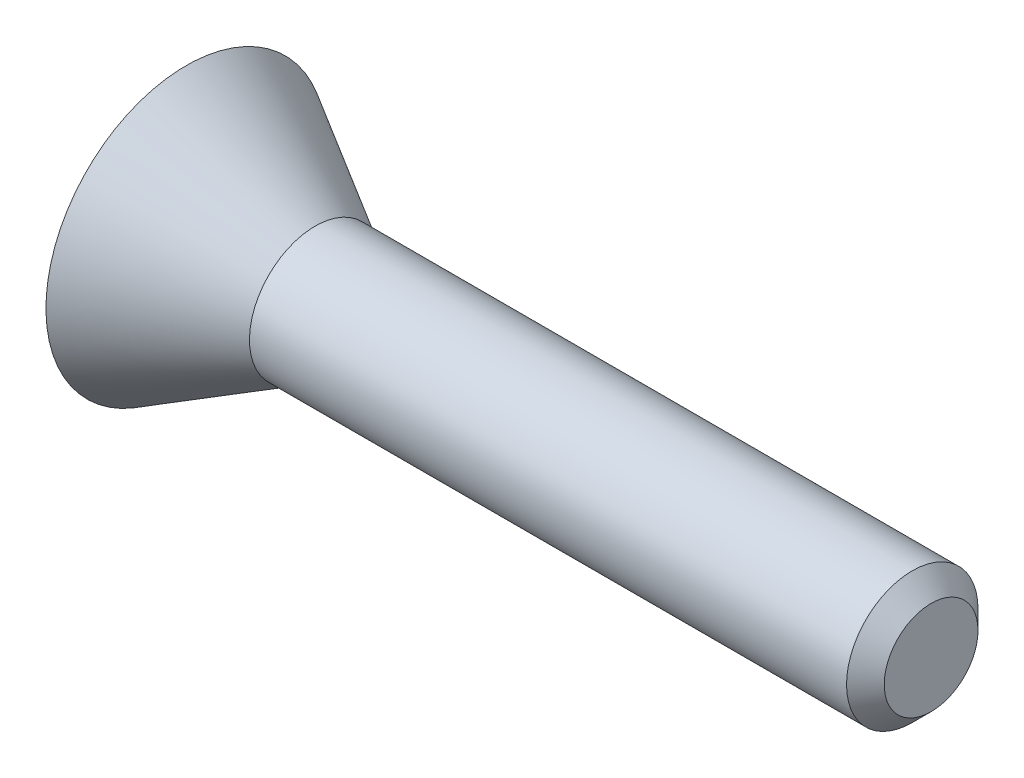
from build123d import *

# Parameters (mm, degrees)
SKETCH1_R           = 3.2
BOSS_EXTRUDE1_DEPTH = 8.5
CUT_EXTRUDE1_DEPTH  = 0.6
CHAMFER1_SIZE       = 0.43
CUT_EXTRUDE2_DEPTH  = 0.6


with BuildPart() as part:
    # Sketch1 → Boss-Extrude1 (new, symmetric)
    with BuildSketch(Plane(origin=(0, 0, 0), x_dir=(0, 0, -1), z_dir=(1, 0, 0))):
        Circle(SKETCH1_R)
    extrude(amount=BOSS_EXTRUDE1_DEPTH, both=True)

    # Sketch2 → Cut-Revolve1 (revolve, cut)
    with BuildSketch(Plane.XY, mode=Mode.PRIVATE) as cut_revolve1_sk:
        Polygon((-5.555513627, 1.5), (8.5, 1.5), (8.5, 3.2), (-8.5, 3.2), align=None)
    revolve(cut_revolve1_sk.sketch.rotate(Axis((-8.5, 0, 0), (1, 0, 0)), 180), axis=Axis((-8.5, 0, 0), (1, 0, 0)), mode=Mode.SUBTRACT)

    # Sketch3 → Cut-Extrude1 (cut)
    with BuildSketch(Plane.ZY.offset(8.5)):
        with BuildLine():
            Line((0.32, 1.41), (0.32, -2.11))
            ThreePointArc((0.32, -2.11), (0, -2.43), (-0.32, -2.11))
            Line((-0.32, -2.11), (-0.32, 1.41))
            Line((-0.32, 1.41), (-0.77, 1.41))
            Line((-0.77, 1.41), (0, 2.69))
            Line((0, 2.69), (0.77, 1.41))
            Line((0.77, 1.41), (0.32, 1.41))
        make_face()
    extrude(amount=-CUT_EXTRUDE1_DEPTH, mode=Mode.SUBTRACT)

    # Chamfer1
    chamfer1_edges = [part.edges().sort_by_distance(p)[0] for p in [
        (8.5, 1.5, 0),
    ]]
    chamfer(chamfer1_edges, length=CHAMFER1_SIZE)

    # Sketch4 → Cut-Extrude2 (cut)
    with BuildSketch(Plane.ZY.offset(8.5)):
        with BuildLine():
            Line((1.962298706, -1.247400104), (1.962298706, -0.856288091))
            Line((1.962298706, -0.856288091), (1.176340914, 0.184965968))
            add(Edge.make_bspline(
                [(1.176340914, 0.184965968), (1.159878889, 0.208161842), (1.127803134, 0.253358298), (1.098772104, 0.31542647), (1.080686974, 0.364088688), (1.072068, 0.399378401), (1.065919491, 0.433048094), (1.065162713, 0.455171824), (1.064794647, 0.465931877)],
                knots=[0, 0, 0, 0, 1.664252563, 3.24274559, 3.998498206, 4.704056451, 5.369707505, 6, 6, 6, 6], degree=3))
            Line((1.064794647, 0.465931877), (1.064794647, 0.469198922))
            add(Edge.make_bspline(
                [(1.064794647, 0.469198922), (1.065432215, 0.483904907), (1.066653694, 0.512079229), (1.078161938, 0.551777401), (1.097023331, 0.586348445), (1.124037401, 0.614904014), (1.157667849, 0.63748975), (1.197907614, 0.653406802), (1.244230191, 0.662534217), (1.277109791, 0.663683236), (1.294421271, 0.664288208)],
                knots=[0, 0, 0, 0, 1.029992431, 1.973301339, 2.872554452, 3.768620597, 4.704316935, 5.693697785, 6.785705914, 8, 8, 8, 8], degree=3))
            add(Edge.make_bspline(
                [(1.294421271, 0.664288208), (1.311329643, 0.66362844), (1.3441832, 0.662346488), (1.390693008, 0.648138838), (1.432602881, 0.625853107), (1.46873252, 0.594054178), (1.498650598, 0.554129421), (1.522932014, 0.507114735), (1.539423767, 0.452161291), (1.545257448, 0.412823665), (1.548317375, 0.392189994)],
                knots=[0, 0, 0, 0, 0.980828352, 1.905783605, 2.800718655, 3.724477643, 4.680224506, 5.688112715, 6.78735127, 8, 8, 8, 8], degree=3))
            Line((1.548317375, 0.392189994), (1.548317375, 0.390789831))
            Line((1.548317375, 0.390789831), (1.990768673, 0.390789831))
            Line((1.990768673, 0.390789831), (1.990768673, 0.392189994))
            add(Edge.make_bspline(
                [(1.990768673, 0.392189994), (1.988585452, 0.418850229), (1.98432385, 0.470890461), (1.970352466, 0.546169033), (1.952295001, 0.617076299), (1.929323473, 0.683598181), (1.899804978, 0.744964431), (1.866640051, 0.802457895), (1.826750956, 0.854300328), (1.783086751, 0.902226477), (1.734452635, 0.944439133), (1.682595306, 0.981676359), (1.626730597, 1.012663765), (1.567707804, 1.03836965), (1.504872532, 1.057879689), (1.439045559, 1.072494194), (1.369471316, 1.080922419), (1.321980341, 1.081946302), (1.297688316, 1.082470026)],
                knots=[0, 0, 0, 0, 1.173229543, 2.290119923, 3.354877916, 4.382703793, 5.372196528, 6.339367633, 7.289741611, 8.236749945, 9.180232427, 10.11040526, 11.033485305, 11.978374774, 12.930610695, 13.916256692, 14.93414813, 16, 16, 16, 16], degree=3))
            add(Edge.make_bspline(
                [(1.297688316, 1.082470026), (1.271530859, 1.082098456), (1.220658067, 1.081375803), (1.146596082, 1.073574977), (1.076911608, 1.061801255), (1.011716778, 1.044576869), (0.951273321, 1.022109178), (0.89540017, 0.995018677), (0.843980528, 0.96307451), (0.797408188, 0.926208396), (0.755504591, 0.885090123), (0.7194369, 0.839302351), (0.688214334, 0.789770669), (0.663807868, 0.735534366), (0.643714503, 0.67786889), (0.630704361, 0.615740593), (0.621937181, 0.549880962), (0.620971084, 0.504544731), (0.620476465, 0.481333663)],
                knots=[0, 0, 0, 0, 1.219700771, 2.37215663, 3.469774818, 4.513610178, 5.512457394, 6.473141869, 7.405450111, 8.330272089, 9.238546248, 10.1372905, 11.043445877, 11.962355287, 12.905558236, 13.886315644, 14.917844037, 16, 16, 16, 16], degree=3))
            Line((0.620476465, 0.481333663), (0.620476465, 0.479466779))
            add(Edge.make_bspline(
                [(0.620476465, 0.479466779), (0.621071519, 0.453297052), (0.622262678, 0.400911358), (0.633014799, 0.322508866), (0.650341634, 0.244506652), (0.674137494, 0.167281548), (0.703698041, 0.092171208), (0.739176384, 0.020204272), (0.779218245, -0.048651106), (0.810947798, -0.091147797), (0.82676705, -0.112335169)],
                knots=[0, 0, 0, 0, 0.984368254, 1.970475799, 2.971844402, 3.988480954, 5.008197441, 6.005725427, 7.005724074, 8, 8, 8, 8], degree=3))
            Line((0.82676705, -0.112335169), (1.390565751, -0.829218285))
            Line((1.390565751, -0.829218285), (0.607875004, -0.829218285))
            Line((0.607875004, -0.829218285), (0.607875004, -1.247400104))
            Line((0.607875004, -1.247400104), (1.962298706, -1.247400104))
        make_face()
        Polygon((-1.903176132, 1.052599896), (-1.903176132, 0.764166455), (-1.389783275, -1.247400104), (-0.922129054, -1.247400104), (-1.419653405, 0.634418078), (-1.026207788, 0.634418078), (-1.026207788, 0.27597652), (-0.594491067, 0.27597652), (-0.594491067, 1.052599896), align=None)
    extrude(amount=-CUT_EXTRUDE2_DEPTH, mode=Mode.SUBTRACT)


solid = part.part
